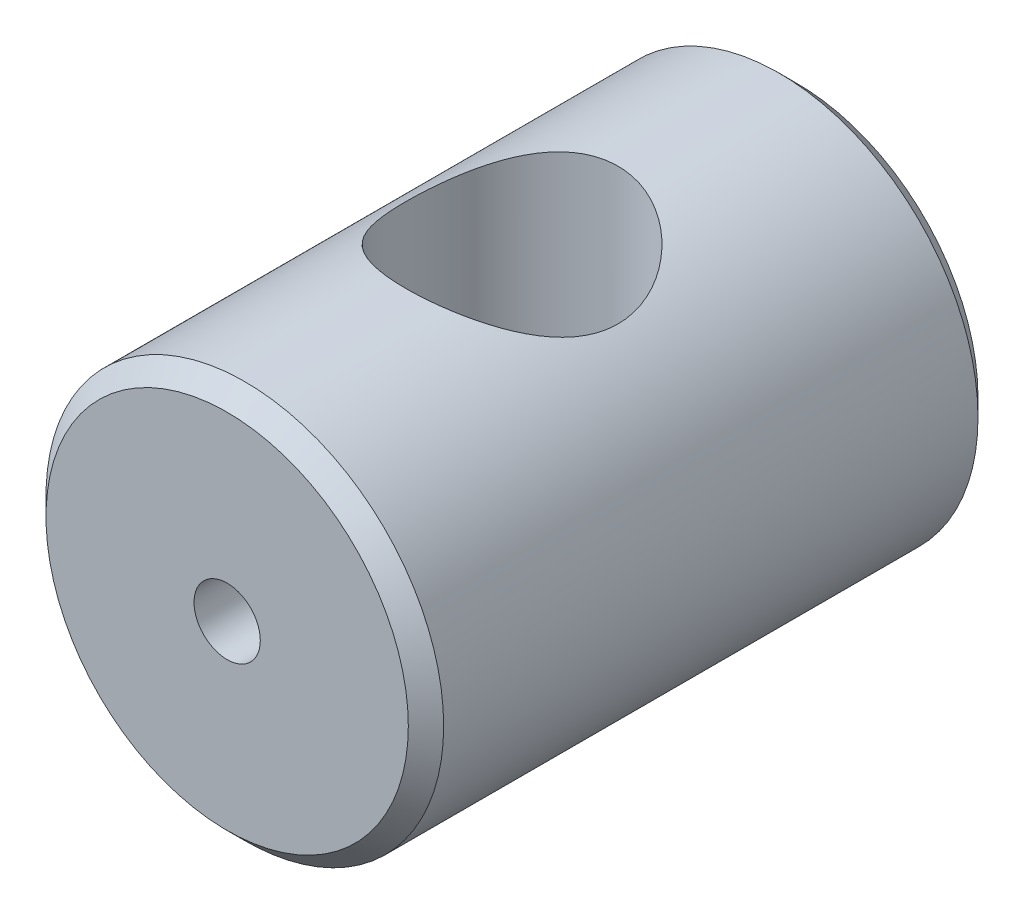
ISO-10303-21;
HEADER;
FILE_DESCRIPTION(('STEP AP214'),'2;1');
FILE_NAME('part.step','',(''),(''),'','','');
FILE_SCHEMA(('AUTOMOTIVE_DESIGN { 1 0 10303 214 1 1 1 1 }'));
ENDSEC;
DATA;
#1=APPLICATION_CONTEXT('core data for automotive mechanical design processes');
#2=APPLICATION_PROTOCOL_DEFINITION('international standard','automotive_design',2000,#1);
#3=PRODUCT_CONTEXT('',#1,'mechanical');
#4=PRODUCT('Part','Part','',(#3));
#5=PRODUCT_RELATED_PRODUCT_CATEGORY('part','',(#4));
#6=PRODUCT_DEFINITION_FORMATION('','',#4);
#7=PRODUCT_DEFINITION_CONTEXT('part definition',#1,'design');
#8=PRODUCT_DEFINITION('design','',#6,#7);
#9=PRODUCT_DEFINITION_SHAPE('','',#8);
#10=(LENGTH_UNIT() NAMED_UNIT(*) SI_UNIT(.MILLI.,.METRE.));
#11=(NAMED_UNIT(*) PLANE_ANGLE_UNIT() SI_UNIT($,.RADIAN.));
#12=(NAMED_UNIT(*) SI_UNIT($,.STERADIAN.) SOLID_ANGLE_UNIT());
#13=UNCERTAINTY_MEASURE_WITH_UNIT(LENGTH_MEASURE(1.E-05),#10,'distance_accuracy_value','');
#14=(GEOMETRIC_REPRESENTATION_CONTEXT(3) GLOBAL_UNCERTAINTY_ASSIGNED_CONTEXT((#13)) GLOBAL_UNIT_ASSIGNED_CONTEXT((#10,
#11,#12)) REPRESENTATION_CONTEXT('',''));
#15=CARTESIAN_POINT('',(0.,0.,0.));
#16=DIRECTION('',(0.,0.,1.));
#17=DIRECTION('',(1.,0.,0.));
#18=AXIS2_PLACEMENT_3D('',#15,#16,#17);
#19=CARTESIAN_POINT('',(0.,0.,0.));
#20=DIRECTION('',(0.,0.,1.));
#21=DIRECTION('',(1.,0.,0.));
#22=AXIS2_PLACEMENT_3D('',#19,#20,#21);
#23=CYLINDRICAL_SURFACE('',#22,3.75);
#24=CARTESIAN_POINT('',(3.75,0.,-43.6318945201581));
#25=CARTESIAN_POINT('',(3.74999861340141,0.20504110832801,-43.6318957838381));
#26=CARTESIAN_POINT('',(3.73312616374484,0.410096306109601,-43.6374873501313));
#27=CARTESIAN_POINT('',(3.66627526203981,0.814182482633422,-43.6591505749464));
#28=CARTESIAN_POINT('',(3.61628786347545,1.01321181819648,-43.6752250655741));
#29=CARTESIAN_POINT('',(3.48509364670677,1.399334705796,-43.7158595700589));
#30=CARTESIAN_POINT('',(3.40394207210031,1.58644869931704,-43.7404045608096));
#31=CARTESIAN_POINT('',(3.2129074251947,1.94445808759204,-43.7951935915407));
#32=CARTESIAN_POINT('',(3.10301927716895,2.11535060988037,-43.8254386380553));
#33=CARTESIAN_POINT('',(2.85358821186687,2.44193660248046,-43.8893852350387));
#34=CARTESIAN_POINT('',(2.71322819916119,2.59699082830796,-43.9231651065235));
#35=CARTESIAN_POINT('',(2.40858613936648,2.88178803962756,-43.9897087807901));
#36=CARTESIAN_POINT('',(2.24430075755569,3.01152749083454,-44.0224724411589));
#37=CARTESIAN_POINT('',(1.89187773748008,3.24483318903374,-44.0841880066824));
#38=CARTESIAN_POINT('',(1.70328466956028,3.34774111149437,-44.1130369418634));
#39=CARTESIAN_POINT('',(1.31041269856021,3.52012814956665,-44.1627579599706));
#40=CARTESIAN_POINT('',(1.10613749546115,3.58961512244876,-44.1836319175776));
#41=CARTESIAN_POINT('',(0.694393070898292,3.69105338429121,-44.2144966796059));
#42=CARTESIAN_POINT('',(0.487217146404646,3.72409724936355,-44.2248035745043));
#43=CARTESIAN_POINT('',(0.0700224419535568,3.75517303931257,-44.2344892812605));
#44=CARTESIAN_POINT('',(-0.139995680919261,3.75321292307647,-44.2338705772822));
#45=CARTESIAN_POINT('',(-0.549223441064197,3.71505512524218,-44.221994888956));
#46=CARTESIAN_POINT('',(-0.748555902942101,3.68004184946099,-44.2111059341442));
#47=CARTESIAN_POINT('',(-1.13835919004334,3.57871502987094,-44.1803658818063));
#48=CARTESIAN_POINT('',(-1.32882943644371,3.51239944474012,-44.1605141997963));
#49=CARTESIAN_POINT('',(-1.69823430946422,3.34958943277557,-44.1135851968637));
#50=CARTESIAN_POINT('',(-1.87699921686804,3.25273557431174,-44.0864224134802));
#51=CARTESIAN_POINT('',(-2.21610753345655,3.03188670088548,-44.0277330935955));
#52=CARTESIAN_POINT('',(-2.37644626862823,2.90788482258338,-43.9962054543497));
#53=CARTESIAN_POINT('',(-2.68121309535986,2.63017909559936,-43.930591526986));
#54=CARTESIAN_POINT('',(-2.82469964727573,2.47545279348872,-43.8964533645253));
#55=CARTESIAN_POINT('',(-3.08396922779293,2.14381469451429,-43.8305998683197));
#56=CARTESIAN_POINT('',(-3.19974899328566,1.96690028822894,-43.798884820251));
#57=CARTESIAN_POINT('',(-3.40141395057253,1.59324759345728,-43.7412068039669));
#58=CARTESIAN_POINT('',(-3.48695042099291,1.39630977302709,-43.715312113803));
#59=CARTESIAN_POINT('',(-3.62335037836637,0.989821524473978,-43.6730077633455));
#60=CARTESIAN_POINT('',(-3.67422632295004,0.780275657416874,-43.6565946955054));
#61=CARTESIAN_POINT('',(-3.73804455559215,0.363540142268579,-43.6358683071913));
#62=CARTESIAN_POINT('',(-3.75242863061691,0.156594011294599,-43.6310953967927));
#63=CARTESIAN_POINT('',(-3.74690233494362,-0.256769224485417,-43.6329137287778));
#64=CARTESIAN_POINT('',(-3.7269972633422,-0.463186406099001,-43.6395032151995));
#65=CARTESIAN_POINT('',(-3.65474620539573,-0.863424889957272,-43.6628501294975));
#66=CARTESIAN_POINT('',(-3.60335493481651,-1.05743782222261,-43.6793080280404));
#67=CARTESIAN_POINT('',(-3.47071120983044,-1.43406537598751,-43.7202200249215));
#68=CARTESIAN_POINT('',(-3.38945388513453,-1.6166781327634,-43.7446754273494));
#69=CARTESIAN_POINT('',(-3.19672531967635,-1.97111732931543,-43.7996975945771));
#70=CARTESIAN_POINT('',(-3.08445442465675,-2.14248424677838,-43.8304195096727));
#71=CARTESIAN_POINT('',(-2.8338192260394,-2.46447103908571,-43.8941918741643));
#72=CARTESIAN_POINT('',(-2.69544814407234,-2.615085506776,-43.927242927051));
#73=CARTESIAN_POINT('',(-2.38971884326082,-2.89773109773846,-43.9936070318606));
#74=CARTESIAN_POINT('',(-2.22139694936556,-3.0287333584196,-44.0268741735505));
#75=CARTESIAN_POINT('',(-1.86435463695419,-3.26067312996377,-44.0885532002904));
#76=CARTESIAN_POINT('',(-1.67563515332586,-3.36161201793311,-44.1169653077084));
#77=CARTESIAN_POINT('',(-1.28431656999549,-3.52959168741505,-44.1655707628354));
#78=CARTESIAN_POINT('',(-1.08183055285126,-3.59687786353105,-44.1858233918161));
#79=CARTESIAN_POINT('',(-0.667671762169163,-3.69621761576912,-44.2160886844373));
#80=CARTESIAN_POINT('',(-0.456001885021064,-3.72828221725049,-44.2261045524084));
#81=CARTESIAN_POINT('',(-0.0389548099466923,-3.75537300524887,-44.2345555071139));
#82=CARTESIAN_POINT('',(0.166317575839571,-3.75188535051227,-44.2334552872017));
#83=CARTESIAN_POINT('',(0.573219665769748,-3.71156456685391,-44.2209107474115));
#84=CARTESIAN_POINT('',(0.774849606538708,-3.67473361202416,-44.2094671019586));
#85=CARTESIAN_POINT('',(1.16626535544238,-3.56971797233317,-44.1776685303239));
#86=CARTESIAN_POINT('',(1.35616775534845,-3.50193117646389,-44.1574268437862));
#87=CARTESIAN_POINT('',(1.72199527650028,-3.33728751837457,-44.1101197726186));
#88=CARTESIAN_POINT('',(1.89791799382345,-3.24042567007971,-44.0830532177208));
#89=CARTESIAN_POINT('',(2.23728508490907,-3.01658172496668,-44.0237783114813));
#90=CARTESIAN_POINT('',(2.40010382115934,-2.88868943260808,-43.9914266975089));
#91=CARTESIAN_POINT('',(2.70246237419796,-2.6080203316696,-43.9256435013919));
#92=CARTESIAN_POINT('',(2.84199520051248,-2.45523607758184,-43.8922115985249));
#93=CARTESIAN_POINT('',(3.09848597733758,-2.1230528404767,-43.8267381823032));
#94=CARTESIAN_POINT('',(3.21454283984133,-1.94293979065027,-43.7947794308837));
#95=CARTESIAN_POINT('',(3.41461412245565,-1.56480563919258,-43.737285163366));
#96=CARTESIAN_POINT('',(3.49864150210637,-1.36679182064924,-43.7117470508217));
#97=CARTESIAN_POINT('',(3.62613541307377,-0.975832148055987,-43.6720782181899));
#98=CARTESIAN_POINT('',(3.6724481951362,-0.783892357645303,-43.6571608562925));
#99=CARTESIAN_POINT('',(3.73437737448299,-0.39463850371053,-43.637069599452));
#100=CARTESIAN_POINT('',(3.75000133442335,-0.197325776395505,-43.631893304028));
#101=CARTESIAN_POINT('',(3.75,0.,-43.6318945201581));
#102=B_SPLINE_CURVE_WITH_KNOTS('',3,(#24,#25,#26,#27,#28,#29,#30,#31,#32,#33,#34,#35,#36,#37,
#38,#39,#40,#41,#42,#43,#44,#45,#46,#47,#48,#49,#50,#51,#52,#53,#54,#55,#56,#57,#58,#59,#60,#61,
#62,#63,#64,#65,#66,#67,#68,#69,#70,#71,#72,#73,#74,#75,#76,#77,#78,#79,#80,#81,#82,#83,#84,#85,
#86,#87,#88,#89,#90,#91,#92,#93,#94,#95,#96,#97,#98,#99,#100,#101),.UNSPECIFIED.,.T.,.F.,(4,2,2,
2,2,2,2,2,2,2,2,2,2,2,2,2,2,2,2,2,2,2,2,2,2,2,2,2,2,2,2,2,2,2,2,2,2,2,4),(0.,0.614394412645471,
1.22895488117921,1.84243093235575,2.45601541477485,3.08871241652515,3.72149768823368,
4.368594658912,5.01553942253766,5.64251168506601,6.26934139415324,6.87452948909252,
7.4797570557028,8.09239213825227,8.70518228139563,9.34351016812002,9.98191319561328,
10.6274541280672,11.2727629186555,11.892147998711,12.5114373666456,13.1128191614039,
13.7142990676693,14.3330283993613,14.9519186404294,15.5964581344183,16.2409680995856,
16.8807071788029,17.5202459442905,18.1331640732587,18.7460422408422,19.3512553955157,
19.9565723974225,20.5824207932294,21.2084567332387,21.8552338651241,22.5017490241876,
23.0931706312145,23.6844464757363),.UNSPECIFIED.);
#103=CARTESIAN_POINT('',(3.75,0.,-43.6318945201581));
#104=VERTEX_POINT('',#103);
#105=EDGE_CURVE('E33',#104,#104,#102,.T.);
#106=ORIENTED_EDGE('',*,*,#105,.T.);
#107=EDGE_LOOP('',(#106));
#108=FACE_BOUND('',#107,.T.);
#109=CARTESIAN_POINT('',(0.,0.,-64.4657628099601));
#110=DIRECTION('',(0.,0.,1.));
#111=DIRECTION('',(1.,0.,0.));
#112=AXIS2_PLACEMENT_3D('',#109,#110,#111);
#113=CIRCLE('',#112,3.75);
#114=CARTESIAN_POINT('',(3.75,0.,-64.4657628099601));
#115=VERTEX_POINT('',#114);
#116=EDGE_CURVE('E104',#115,#115,#113,.T.);
#117=ORIENTED_EDGE('',*,*,#116,.F.);
#118=EDGE_LOOP('',(#117));
#119=FACE_BOUND('',#118,.T.);
#120=ADVANCED_FACE('F29',(#108,#119),#23,.F.);
#121=CARTESIAN_POINT('',(0.,0.,-2.));
#122=DIRECTION('',(0.,0.,-1.));
#123=DIRECTION('',(-1.,0.,0.));
#124=AXIS2_PLACEMENT_3D('',#121,#122,#123);
#125=CONICAL_SURFACE('',#124,22.5,0.785398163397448);
#126=CARTESIAN_POINT('',(0.,0.,0.));
#127=DIRECTION('',(0.,0.,1.));
#128=DIRECTION('',(1.,0.,0.));
#129=AXIS2_PLACEMENT_3D('',#126,#127,#128);
#130=CIRCLE('',#129,20.5);
#131=CARTESIAN_POINT('',(20.5,0.,0.));
#132=VERTEX_POINT('',#131);
#133=EDGE_CURVE('E109',#132,#132,#130,.T.);
#134=ORIENTED_EDGE('',*,*,#133,.F.);
#135=EDGE_LOOP('',(#134));
#136=FACE_BOUND('',#135,.T.);
#137=CARTESIAN_POINT('',(0.,0.,-2.));
#138=DIRECTION('',(0.,0.,1.));
#139=DIRECTION('',(1.,0.,0.));
#140=AXIS2_PLACEMENT_3D('',#137,#138,#139);
#141=CIRCLE('',#140,22.5);
#142=CARTESIAN_POINT('',(22.5,0.,-2.));
#143=VERTEX_POINT('',#142);
#144=EDGE_CURVE('E10',#143,#143,#141,.T.);
#145=ORIENTED_EDGE('',*,*,#144,.T.);
#146=EDGE_LOOP('',(#145));
#147=FACE_BOUND('',#146,.T.);
#148=ADVANCED_FACE('F31',(#136,#147),#125,.T.);
#149=CARTESIAN_POINT('',(0.,0.,0.));
#150=DIRECTION('',(0.,0.,1.));
#151=DIRECTION('',(1.,0.,0.));
#152=AXIS2_PLACEMENT_3D('',#149,#150,#151);
#153=CYLINDRICAL_SURFACE('',#152,22.5);
#154=CARTESIAN_POINT('',(0.,-22.5,-20.2328814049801));
#155=CARTESIAN_POINT('',(0.312987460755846,-22.5000011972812,-20.2328799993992));
#156=CARTESIAN_POINT('',(0.625957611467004,-22.4934556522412,-20.245138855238));
#157=CARTESIAN_POINT('',(1.24955990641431,-22.4674432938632,-20.2940188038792));
#158=CARTESIAN_POINT('',(1.56019121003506,-22.4479720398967,-20.3306482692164));
#159=CARTESIAN_POINT('',(2.17705516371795,-22.3965704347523,-20.4278795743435));
#160=CARTESIAN_POINT('',(2.48328125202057,-22.3646231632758,-20.4885139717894));
#161=CARTESIAN_POINT('',(3.08869256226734,-22.2890788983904,-20.633018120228));
#162=CARTESIAN_POINT('',(3.38787831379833,-22.2454827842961,-20.7168861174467));
#163=CARTESIAN_POINT('',(3.97607237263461,-22.1478977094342,-20.906542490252));
#164=CARTESIAN_POINT('',(4.26511728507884,-22.0939519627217,-21.0122398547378));
#165=CARTESIAN_POINT('',(4.8326395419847,-21.9767959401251,-21.2447224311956));
#166=CARTESIAN_POINT('',(5.111116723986,-21.9135855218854,-21.3715079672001));
#167=CARTESIAN_POINT('',(5.65599633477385,-21.7793118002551,-21.6450293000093));
#168=CARTESIAN_POINT('',(5.92240225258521,-21.7082507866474,-21.7917592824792));
#169=CARTESIAN_POINT('',(6.44212507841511,-21.5597334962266,-22.1041599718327));
#170=CARTESIAN_POINT('',(6.69543675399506,-21.4822746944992,-22.2698381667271));
#171=CARTESIAN_POINT('',(7.20407024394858,-21.3173046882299,-22.6305444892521));
#172=CARTESIAN_POINT('',(7.45842524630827,-21.2294674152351,-22.8267870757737));
#173=CARTESIAN_POINT('',(7.94991361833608,-21.0503515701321,-23.2383482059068));
#174=CARTESIAN_POINT('',(8.18704584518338,-20.9590727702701,-23.4536680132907));
#175=CARTESIAN_POINT('',(8.64326195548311,-20.775094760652,-23.9024267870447));
#176=CARTESIAN_POINT('',(8.86233274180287,-20.682394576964,-24.1358786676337));
#177=CARTESIAN_POINT('',(9.28131663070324,-20.4977946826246,-24.6197604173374));
#178=CARTESIAN_POINT('',(9.48122591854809,-20.4058951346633,-24.870193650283));
#179=CARTESIAN_POINT('',(9.87825035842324,-20.2168946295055,-25.410663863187));
#180=CARTESIAN_POINT('',(10.0734338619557,-20.1200878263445,-25.7022275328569));
#181=CARTESIAN_POINT('',(10.4382761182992,-19.933248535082,-26.3028068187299));
#182=CARTESIAN_POINT('',(10.6079457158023,-19.8432131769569,-26.6118149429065));
#183=CARTESIAN_POINT('',(10.9202934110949,-19.6730482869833,-27.2457001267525));
#184=CARTESIAN_POINT('',(11.062980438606,-19.5929154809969,-27.5705718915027));
#185=CARTESIAN_POINT('',(11.319791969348,-19.4456743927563,-28.2342729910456));
#186=CARTESIAN_POINT('',(11.4339200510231,-19.3785644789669,-28.5731005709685));
#187=CARTESIAN_POINT('',(11.625824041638,-19.2640059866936,-29.240692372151));
#188=CARTESIAN_POINT('',(11.7054238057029,-19.2155919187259,-29.5687654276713));
#189=CARTESIAN_POINT('',(11.8369094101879,-19.1348780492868,-30.2323916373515));
#190=CARTESIAN_POINT('',(11.8887965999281,-19.1025774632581,-30.5679444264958));
#191=CARTESIAN_POINT('',(11.9639290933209,-19.055612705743,-31.2431098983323));
#192=CARTESIAN_POINT('',(11.9872053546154,-19.0409294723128,-31.5827177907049));
#193=CARTESIAN_POINT('',(12.0047828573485,-19.0298533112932,-32.2629630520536));
#194=CARTESIAN_POINT('',(11.999087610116,-19.0334581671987,-32.6036002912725));
#195=CARTESIAN_POINT('',(11.9616887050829,-19.0569767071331,-33.2345610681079));
#196=CARTESIAN_POINT('',(11.9337648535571,-19.0745195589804,-33.5252076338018));
#197=CARTESIAN_POINT('',(11.857011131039,-19.1223255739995,-34.1026712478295));
#198=CARTESIAN_POINT('',(11.8081809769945,-19.152588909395,-34.3894882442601));
#199=CARTESIAN_POINT('',(11.6902009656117,-19.2248269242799,-34.9574676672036));
#200=CARTESIAN_POINT('',(11.6210457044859,-19.2668047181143,-35.2386285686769));
#201=CARTESIAN_POINT('',(11.4631767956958,-19.3611472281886,-35.7936151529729));
#202=CARTESIAN_POINT('',(11.3744619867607,-19.413512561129,-36.0674403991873));
#203=CARTESIAN_POINT('',(11.176136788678,-19.5283736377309,-36.6123674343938));
#204=CARTESIAN_POINT('',(11.0661065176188,-19.5910683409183,-36.8832740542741));
#205=CARTESIAN_POINT('',(10.8273602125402,-19.7240192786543,-37.4148900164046));
#206=CARTESIAN_POINT('',(10.6986379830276,-19.7942780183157,-37.6755959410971));
#207=CARTESIAN_POINT('',(10.423390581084,-19.9405921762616,-38.1857760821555));
#208=CARTESIAN_POINT('',(10.2768627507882,-20.0166484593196,-38.4352486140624));
#209=CARTESIAN_POINT('',(9.96683257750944,-20.1728128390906,-38.9220928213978));
#210=CARTESIAN_POINT('',(9.80332870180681,-20.2529213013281,-39.1594634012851));
#211=CARTESIAN_POINT('',(9.43482417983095,-20.4274701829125,-39.6553504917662));
#212=CARTESIAN_POINT('',(9.22725830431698,-20.5222840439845,-39.911834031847));
#213=CARTESIAN_POINT('',(8.79194288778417,-20.712511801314,-40.4066379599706));
#214=CARTESIAN_POINT('',(8.56419997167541,-20.807925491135,-40.6449642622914));
#215=CARTESIAN_POINT('',(8.08926719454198,-20.9971224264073,-41.1026396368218));
#216=CARTESIAN_POINT('',(7.84205819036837,-21.0909039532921,-41.3219695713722));
#217=CARTESIAN_POINT('',(7.32958495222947,-21.2744267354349,-41.7400628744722));
#218=CARTESIAN_POINT('',(7.06432785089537,-21.3641695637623,-41.9388342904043));
#219=CARTESIAN_POINT('',(6.50044190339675,-21.5426750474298,-42.3258531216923));
#220=CARTESIAN_POINT('',(6.20076575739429,-21.6310564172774,-42.5127552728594));
#221=CARTESIAN_POINT('',(5.58404497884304,-21.7984063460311,-42.8603803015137));
#222=CARTESIAN_POINT('',(5.26699934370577,-21.8773743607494,-43.0211016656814));
#223=CARTESIAN_POINT('',(4.61783640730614,-22.0235370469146,-43.3145039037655));
#224=CARTESIAN_POINT('',(4.28573003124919,-22.0907400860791,-43.4472047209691));
#225=CARTESIAN_POINT('',(3.60875197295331,-22.2113722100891,-43.683005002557));
#226=CARTESIAN_POINT('',(3.26388199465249,-22.2648031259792,-43.7861084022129));
#227=CARTESIAN_POINT('',(2.59579375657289,-22.3520681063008,-43.9533573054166));
#228=CARTESIAN_POINT('',(2.27341574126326,-22.3872319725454,-44.0201715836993));
#229=CARTESIAN_POINT('',(1.62307211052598,-22.4437548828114,-44.1271744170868));
#230=CARTESIAN_POINT('',(1.29510682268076,-22.4651147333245,-44.1673645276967));
#231=CARTESIAN_POINT('',(0.6365177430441,-22.4934086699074,-44.2205392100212));
#232=CARTESIAN_POINT('',(0.305895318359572,-22.5003497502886,-44.2335369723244));
#233=CARTESIAN_POINT('',(-0.355268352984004,-22.4996231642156,-44.2321750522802));
#234=CARTESIAN_POINT('',(-0.685809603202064,-22.4919563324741,-44.2178169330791));
#235=CARTESIAN_POINT('',(-1.31400152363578,-22.4635955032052,-44.1645018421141));
#236=CARTESIAN_POINT('',(-1.61191218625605,-22.4441482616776,-44.1278981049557));
#237=CARTESIAN_POINT('',(-2.20319493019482,-22.3938373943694,-44.0326944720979));
#238=CARTESIAN_POINT('',(-2.49656735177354,-22.3629746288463,-43.9740962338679));
#239=CARTESIAN_POINT('',(-3.07687716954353,-22.2905438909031,-43.8355462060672));
#240=CARTESIAN_POINT('',(-3.36381423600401,-22.2489753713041,-43.7555933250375));
#241=CARTESIAN_POINT('',(-3.92952573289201,-22.1560602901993,-43.5751468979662));
#242=CARTESIAN_POINT('',(-4.20829980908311,-22.1047133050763,-43.4746524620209));
#243=CARTESIAN_POINT('',(-4.76293280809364,-21.9919649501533,-43.2513223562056));
#244=CARTESIAN_POINT('',(-5.03854995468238,-21.9303467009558,-43.1279964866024));
#245=CARTESIAN_POINT('',(-5.57832551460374,-21.7992994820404,-42.8617519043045));
#246=CARTESIAN_POINT('',(-5.84247981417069,-21.7298677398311,-42.7188262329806));
#247=CARTESIAN_POINT('',(-6.3580944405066,-21.5846331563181,-42.4144470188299));
#248=CARTESIAN_POINT('',(-6.60955287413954,-21.5088293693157,-42.2529907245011));
#249=CARTESIAN_POINT('',(-7.09872296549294,-21.3523788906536,-41.9125988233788));
#250=CARTESIAN_POINT('',(-7.33643497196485,-21.2717323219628,-41.7336636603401));
#251=CARTESIAN_POINT('',(-7.82210401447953,-21.0982970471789,-41.3390795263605));
#252=CARTESIAN_POINT('',(-8.06840437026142,-21.0051364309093,-41.1215521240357));
#253=CARTESIAN_POINT('',(-8.54201888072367,-20.8170328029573,-40.6674274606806));
#254=CARTESIAN_POINT('',(-8.76933190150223,-20.7220896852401,-40.4308290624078));
#255=CARTESIAN_POINT('',(-9.20411714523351,-20.532669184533,-39.9394969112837));
#256=CARTESIAN_POINT('',(-9.41157291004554,-20.4381922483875,-39.6847484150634));
#257=CARTESIAN_POINT('',(-9.8054013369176,-20.252198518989,-39.1583542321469));
#258=CARTESIAN_POINT('',(-9.99177057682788,-20.1606822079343,-38.8867058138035));
#259=CARTESIAN_POINT('',(-10.3541352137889,-19.9771340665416,-38.308731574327));
#260=CARTESIAN_POINT('',(-10.5285731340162,-19.8854871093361,-38.0013031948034));
#261=CARTESIAN_POINT('',(-10.8504816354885,-19.7116847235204,-37.3702386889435));
#262=CARTESIAN_POINT('',(-10.9979651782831,-19.6295247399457,-37.0466104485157));
#263=CARTESIAN_POINT('',(-11.2643222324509,-19.477898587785,-36.3852306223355));
#264=CARTESIAN_POINT('',(-11.3832214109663,-19.4084210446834,-36.0474920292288));
#265=CARTESIAN_POINT('',(-11.5909142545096,-19.2851067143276,-35.360107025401));
#266=CARTESIAN_POINT('',(-11.6797132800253,-19.2312671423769,-35.0104627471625));
#267=CARTESIAN_POINT('',(-11.8185839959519,-19.1462014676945,-34.337028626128));
#268=CARTESIAN_POINT('',(-11.871595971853,-19.1132775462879,-34.0140586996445));
#269=CARTESIAN_POINT('',(-11.9510970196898,-19.0636696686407,-33.36362763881));
#270=CARTESIAN_POINT('',(-11.9775880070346,-19.0469845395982,-33.036166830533));
#271=CARTESIAN_POINT('',(-12.0035888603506,-19.0306093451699,-32.3799412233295));
#272=CARTESIAN_POINT('',(-12.0031143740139,-19.0309094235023,-32.0511772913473));
#273=CARTESIAN_POINT('',(-11.9752297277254,-19.04846838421,-31.3952650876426));
#274=CARTESIAN_POINT('',(-11.9478213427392,-19.0657261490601,-31.0681167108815));
#275=CARTESIAN_POINT('',(-11.8715099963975,-19.1133191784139,-30.4580821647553));
#276=CARTESIAN_POINT('',(-11.8256363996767,-19.1418026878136,-30.1746641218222));
#277=CARTESIAN_POINT('',(-11.7140375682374,-19.2102995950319,-29.6130916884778));
#278=CARTESIAN_POINT('',(-11.6483059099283,-19.2503167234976,-29.3349390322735));
#279=CARTESIAN_POINT('',(-11.4977195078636,-19.3406343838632,-28.785628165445));
#280=CARTESIAN_POINT('',(-11.4128670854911,-19.390933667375,-28.5144691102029));
#281=CARTESIAN_POINT('',(-11.2247926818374,-19.5004067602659,-27.9803238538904));
#282=CARTESIAN_POINT('',(-11.1215624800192,-19.5595845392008,-27.717341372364));
#283=CARTESIAN_POINT('',(-10.8903909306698,-19.6892877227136,-27.1842051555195));
#284=CARTESIAN_POINT('',(-10.7612895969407,-19.7602974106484,-26.9146726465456));
#285=CARTESIAN_POINT('',(-10.4841899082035,-19.9087030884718,-26.3873273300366));
#286=CARTESIAN_POINT('',(-10.3361896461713,-19.9860997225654,-26.1295157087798));
#287=CARTESIAN_POINT('',(-10.0221416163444,-20.1454134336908,-25.6264733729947));
#288=CARTESIAN_POINT('',(-9.8560875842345,-20.2273320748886,-25.3812470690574));
#289=CARTESIAN_POINT('',(-9.50678662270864,-20.3938336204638,-24.9042794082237));
#290=CARTESIAN_POINT('',(-9.32353716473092,-20.478416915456,-24.6725400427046));
#291=CARTESIAN_POINT('',(-8.91286790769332,-20.660791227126,-24.190807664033));
#292=CARTESIAN_POINT('',(-8.68289554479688,-20.7587198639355,-23.9430364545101));
#293=CARTESIAN_POINT('',(-8.20264060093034,-20.9531329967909,-23.4675608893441));
#294=CARTESIAN_POINT('',(-7.9523632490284,-21.049617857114,-23.239851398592));
#295=CARTESIAN_POINT('',(-7.43236758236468,-21.2387973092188,-22.805540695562));
#296=CARTESIAN_POINT('',(-7.16263282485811,-21.3314885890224,-22.5989577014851));
#297=CARTESIAN_POINT('',(-6.60520490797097,-21.5106243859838,-22.2085588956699));
#298=CARTESIAN_POINT('',(-6.3175124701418,-21.5970691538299,-22.0247421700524));
#299=CARTESIAN_POINT('',(-5.71839210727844,-21.7634780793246,-21.6771801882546));
#300=CARTESIAN_POINT('',(-5.40655543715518,-21.8432316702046,-21.5140367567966));
#301=CARTESIAN_POINT('',(-4.76756488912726,-21.991540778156,-21.2149536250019));
#302=CARTESIAN_POINT('',(-4.44041297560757,-22.0600977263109,-21.0790104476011));
#303=CARTESIAN_POINT('',(-3.77385042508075,-22.1838383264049,-20.836234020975));
#304=CARTESIAN_POINT('',(-3.43446852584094,-22.2390512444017,-20.7293370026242));
#305=CARTESIAN_POINT('',(-2.74573878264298,-22.3345400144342,-20.5458018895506));
#306=CARTESIAN_POINT('',(-2.39639657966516,-22.3748241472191,-20.4691470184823));
#307=CARTESIAN_POINT('',(-1.70723479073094,-22.437679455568,-20.350041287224));
#308=CARTESIAN_POINT('',(-1.36772862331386,-22.4609876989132,-20.306164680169));
#309=CARTESIAN_POINT('',(-0.685474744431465,-22.4921474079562,-20.2475853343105));
#310=CARTESIAN_POINT('',(-0.342726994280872,-22.4999986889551,-20.2328829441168));
#311=CARTESIAN_POINT('',(0.,-22.5,-20.2328814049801));
#312=B_SPLINE_CURVE_WITH_KNOTS('',3,(#154,#155,#156,#157,#158,#159,#160,#161,#162,#163,#164,
#165,#166,#167,#168,#169,#170,#171,#172,#173,#174,#175,#176,#177,#178,#179,#180,#181,#182,#183,
#184,#185,#186,#187,#188,#189,#190,#191,#192,#193,#194,#195,#196,#197,#198,#199,#200,#201,#202,
#203,#204,#205,#206,#207,#208,#209,#210,#211,#212,#213,#214,#215,#216,#217,#218,#219,#220,#221,
#222,#223,#224,#225,#226,#227,#228,#229,#230,#231,#232,#233,#234,#235,#236,#237,#238,#239,#240,
#241,#242,#243,#244,#245,#246,#247,#248,#249,#250,#251,#252,#253,#254,#255,#256,#257,#258,#259,
#260,#261,#262,#263,#264,#265,#266,#267,#268,#269,#270,#271,#272,#273,#274,#275,#276,#277,#278,
#279,#280,#281,#282,#283,#284,#285,#286,#287,#288,#289,#290,#291,#292,#293,#294,#295,#296,#297,
#298,#299,#300,#301,#302,#303,#304,#305,#306,#307,#308,#309,#310,#311),.UNSPECIFIED.,.T.,.F.,(4,
2,2,2,2,2,2,2,2,2,2,2,2,2,2,2,2,2,2,2,2,2,2,2,2,2,2,2,2,2,2,2,2,2,2,2,2,2,2,2,2,2,2,2,2,2,2,2,2,
2,2,2,2,2,2,2,2,2,2,2,2,2,2,2,2,2,2,2,2,2,2,2,2,2,2,2,2,2,4),(0.,0.938626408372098,
1.87757544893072,2.81780236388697,3.75795832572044,4.69427097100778,5.63059800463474,
6.56665265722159,7.50307850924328,8.50119081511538,9.49936929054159,10.4982653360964,
11.4973598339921,12.5879296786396,13.6780346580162,14.7677782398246,15.8573852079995,
16.8790072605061,17.9005795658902,18.921045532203,19.9413878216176,20.8178842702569,
21.6943925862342,22.5711341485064,23.4479277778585,24.3441718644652,25.2407136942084,
26.1373895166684,27.0341463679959,28.0629489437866,29.0914149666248,30.1209053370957,
31.1499911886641,32.240769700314,33.3316112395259,34.4216737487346,35.5115912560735,
36.5035389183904,37.4954286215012,38.4868370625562,39.4781888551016,40.379479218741,
41.2807016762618,42.1819702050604,43.0832777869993,44.0068311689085,44.9307132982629,
45.8547327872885,46.778728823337,47.8023019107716,48.8259360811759,49.850411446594,
50.8750528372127,51.9690907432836,53.0626011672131,54.1551259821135,55.247456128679,
56.2328489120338,57.2181705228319,58.2029203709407,59.187605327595,60.0521908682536,
60.9170563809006,61.781816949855,62.6469653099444,63.5675813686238,64.4882903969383,
65.4093199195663,66.3304850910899,67.3851488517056,68.439541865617,69.4948365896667,
70.5500889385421,71.6311854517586,72.7121436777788,73.790709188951,74.8686755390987,
75.8964763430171,76.924289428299),.UNSPECIFIED.);
#313=CARTESIAN_POINT('',(0.,-22.5,-20.2328814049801));
#314=VERTEX_POINT('',#313);
#315=EDGE_CURVE('E71',#314,#314,#312,.T.);
#316=ORIENTED_EDGE('',*,*,#315,.T.);
#317=EDGE_LOOP('',(#316));
#318=FACE_BOUND('',#317,.T.);
#319=CARTESIAN_POINT('',(0.,22.5,-20.2328814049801));
#320=CARTESIAN_POINT('',(-0.312987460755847,22.5000011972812,-20.2328799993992));
#321=CARTESIAN_POINT('',(-0.625957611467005,22.4934556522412,-20.245138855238));
#322=CARTESIAN_POINT('',(-1.24955990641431,22.4674432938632,-20.2940188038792));
#323=CARTESIAN_POINT('',(-1.56019121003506,22.4479720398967,-20.3306482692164));
#324=CARTESIAN_POINT('',(-2.17705516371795,22.3965704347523,-20.4278795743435));
#325=CARTESIAN_POINT('',(-2.48328125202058,22.3646231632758,-20.4885139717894));
#326=CARTESIAN_POINT('',(-3.08869256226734,22.2890788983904,-20.633018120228));
#327=CARTESIAN_POINT('',(-3.38787831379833,22.2454827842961,-20.7168861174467));
#328=CARTESIAN_POINT('',(-3.97607237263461,22.1478977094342,-20.906542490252));
#329=CARTESIAN_POINT('',(-4.26511728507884,22.0939519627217,-21.0122398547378));
#330=CARTESIAN_POINT('',(-4.8326395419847,21.9767959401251,-21.2447224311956));
#331=CARTESIAN_POINT('',(-5.111116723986,21.9135855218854,-21.3715079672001));
#332=CARTESIAN_POINT('',(-5.65599633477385,21.7793118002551,-21.6450293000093));
#333=CARTESIAN_POINT('',(-5.92240225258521,21.7082507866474,-21.7917592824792));
#334=CARTESIAN_POINT('',(-6.44212507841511,21.5597334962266,-22.1041599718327));
#335=CARTESIAN_POINT('',(-6.69543675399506,21.4822746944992,-22.2698381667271));
#336=CARTESIAN_POINT('',(-7.20407024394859,21.3173046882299,-22.6305444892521));
#337=CARTESIAN_POINT('',(-7.45842524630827,21.2294674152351,-22.8267870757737));
#338=CARTESIAN_POINT('',(-7.94991361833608,21.0503515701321,-23.2383482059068));
#339=CARTESIAN_POINT('',(-8.18704584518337,20.9590727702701,-23.4536680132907));
#340=CARTESIAN_POINT('',(-8.64326195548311,20.775094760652,-23.9024267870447));
#341=CARTESIAN_POINT('',(-8.86233274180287,20.682394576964,-24.1358786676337));
#342=CARTESIAN_POINT('',(-9.28131663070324,20.4977946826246,-24.6197604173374));
#343=CARTESIAN_POINT('',(-9.48122591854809,20.4058951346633,-24.8701936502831));
#344=CARTESIAN_POINT('',(-9.87825035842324,20.2168946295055,-25.410663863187));
#345=CARTESIAN_POINT('',(-10.0734338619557,20.1200878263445,-25.7022275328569));
#346=CARTESIAN_POINT('',(-10.4382761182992,19.933248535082,-26.3028068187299));
#347=CARTESIAN_POINT('',(-10.6079457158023,19.8432131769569,-26.6118149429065));
#348=CARTESIAN_POINT('',(-10.9202934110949,19.6730482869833,-27.2457001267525));
#349=CARTESIAN_POINT('',(-11.062980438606,19.5929154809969,-27.5705718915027));
#350=CARTESIAN_POINT('',(-11.319791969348,19.4456743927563,-28.2342729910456));
#351=CARTESIAN_POINT('',(-11.4339200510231,19.3785644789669,-28.5731005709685));
#352=CARTESIAN_POINT('',(-11.625824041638,19.2640059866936,-29.240692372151));
#353=CARTESIAN_POINT('',(-11.7054238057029,19.2155919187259,-29.5687654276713));
#354=CARTESIAN_POINT('',(-11.8369094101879,19.1348780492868,-30.2323916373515));
#355=CARTESIAN_POINT('',(-11.8887965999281,19.1025774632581,-30.5679444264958));
#356=CARTESIAN_POINT('',(-11.9639290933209,19.055612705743,-31.2431098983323));
#357=CARTESIAN_POINT('',(-11.9872053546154,19.0409294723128,-31.5827177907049));
#358=CARTESIAN_POINT('',(-12.0047828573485,19.0298533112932,-32.2629630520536));
#359=CARTESIAN_POINT('',(-11.999087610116,19.0334581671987,-32.6036002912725));
#360=CARTESIAN_POINT('',(-11.9616887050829,19.0569767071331,-33.2345610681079));
#361=CARTESIAN_POINT('',(-11.9337648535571,19.0745195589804,-33.5252076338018));
#362=CARTESIAN_POINT('',(-11.857011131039,19.1223255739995,-34.1026712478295));
#363=CARTESIAN_POINT('',(-11.8081809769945,19.152588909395,-34.3894882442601));
#364=CARTESIAN_POINT('',(-11.6902009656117,19.2248269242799,-34.9574676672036));
#365=CARTESIAN_POINT('',(-11.6210457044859,19.2668047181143,-35.2386285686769));
#366=CARTESIAN_POINT('',(-11.4631767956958,19.3611472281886,-35.7936151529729));
#367=CARTESIAN_POINT('',(-11.3744619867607,19.413512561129,-36.0674403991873));
#368=CARTESIAN_POINT('',(-11.176136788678,19.5283736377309,-36.6123674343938));
#369=CARTESIAN_POINT('',(-11.0661065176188,19.5910683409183,-36.8832740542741));
#370=CARTESIAN_POINT('',(-10.8273602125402,19.7240192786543,-37.4148900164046));
#371=CARTESIAN_POINT('',(-10.6986379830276,19.7942780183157,-37.6755959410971));
#372=CARTESIAN_POINT('',(-10.423390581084,19.9405921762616,-38.1857760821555));
#373=CARTESIAN_POINT('',(-10.2768627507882,20.0166484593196,-38.4352486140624));
#374=CARTESIAN_POINT('',(-9.96683257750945,20.1728128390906,-38.9220928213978));
#375=CARTESIAN_POINT('',(-9.80332870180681,20.2529213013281,-39.1594634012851));
#376=CARTESIAN_POINT('',(-9.43482417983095,20.4274701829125,-39.6553504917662));
#377=CARTESIAN_POINT('',(-9.22725830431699,20.5222840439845,-39.911834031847));
#378=CARTESIAN_POINT('',(-8.79194288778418,20.712511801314,-40.4066379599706));
#379=CARTESIAN_POINT('',(-8.56419997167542,20.807925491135,-40.6449642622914));
#380=CARTESIAN_POINT('',(-8.08926719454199,20.9971224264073,-41.1026396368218));
#381=CARTESIAN_POINT('',(-7.84205819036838,21.0909039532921,-41.3219695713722));
#382=CARTESIAN_POINT('',(-7.32958495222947,21.2744267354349,-41.7400628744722));
#383=CARTESIAN_POINT('',(-7.06432785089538,21.3641695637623,-41.9388342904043));
#384=CARTESIAN_POINT('',(-6.50044190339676,21.5426750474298,-42.3258531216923));
#385=CARTESIAN_POINT('',(-6.20076575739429,21.6310564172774,-42.5127552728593));
#386=CARTESIAN_POINT('',(-5.58404497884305,21.7984063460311,-42.8603803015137));
#387=CARTESIAN_POINT('',(-5.26699934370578,21.8773743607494,-43.0211016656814));
#388=CARTESIAN_POINT('',(-4.61783640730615,22.0235370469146,-43.3145039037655));
#389=CARTESIAN_POINT('',(-4.2857300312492,22.090740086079,-43.4472047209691));
#390=CARTESIAN_POINT('',(-3.60875197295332,22.2113722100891,-43.683005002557));
#391=CARTESIAN_POINT('',(-3.2638819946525,22.2648031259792,-43.7861084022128));
#392=CARTESIAN_POINT('',(-2.5957937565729,22.3520681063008,-43.9533573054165));
#393=CARTESIAN_POINT('',(-2.27341574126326,22.3872319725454,-44.0201715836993));
#394=CARTESIAN_POINT('',(-1.62307211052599,22.4437548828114,-44.1271744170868));
#395=CARTESIAN_POINT('',(-1.29510682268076,22.4651147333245,-44.1673645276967));
#396=CARTESIAN_POINT('',(-0.636517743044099,22.4934086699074,-44.2205392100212));
#397=CARTESIAN_POINT('',(-0.305895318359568,22.5003497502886,-44.2335369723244));
#398=CARTESIAN_POINT('',(0.355268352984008,22.4996231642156,-44.2321750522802));
#399=CARTESIAN_POINT('',(0.685809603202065,22.4919563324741,-44.2178169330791));
#400=CARTESIAN_POINT('',(1.31400152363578,22.4635955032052,-44.1645018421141));
#401=CARTESIAN_POINT('',(1.61191218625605,22.4441482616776,-44.1278981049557));
#402=CARTESIAN_POINT('',(2.20319493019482,22.3938373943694,-44.0326944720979));
#403=CARTESIAN_POINT('',(2.49656735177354,22.3629746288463,-43.9740962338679));
#404=CARTESIAN_POINT('',(3.07687716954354,22.2905438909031,-43.8355462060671));
#405=CARTESIAN_POINT('',(3.36381423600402,22.2489753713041,-43.7555933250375));
#406=CARTESIAN_POINT('',(3.92952573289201,22.1560602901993,-43.5751468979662));
#407=CARTESIAN_POINT('',(4.20829980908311,22.1047133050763,-43.4746524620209));
#408=CARTESIAN_POINT('',(4.76293280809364,21.9919649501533,-43.2513223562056));
#409=CARTESIAN_POINT('',(5.03854995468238,21.9303467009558,-43.1279964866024));
#410=CARTESIAN_POINT('',(5.57832551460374,21.7992994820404,-42.8617519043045));
#411=CARTESIAN_POINT('',(5.84247981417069,21.7298677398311,-42.7188262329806));
#412=CARTESIAN_POINT('',(6.3580944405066,21.5846331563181,-42.4144470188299));
#413=CARTESIAN_POINT('',(6.60955287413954,21.5088293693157,-42.2529907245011));
#414=CARTESIAN_POINT('',(7.09872296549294,21.3523788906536,-41.9125988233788));
#415=CARTESIAN_POINT('',(7.33643497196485,21.2717323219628,-41.7336636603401));
#416=CARTESIAN_POINT('',(7.82210401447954,21.0982970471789,-41.3390795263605));
#417=CARTESIAN_POINT('',(8.06840437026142,21.0051364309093,-41.1215521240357));
#418=CARTESIAN_POINT('',(8.54201888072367,20.8170328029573,-40.6674274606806));
#419=CARTESIAN_POINT('',(8.76933190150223,20.7220896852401,-40.4308290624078));
#420=CARTESIAN_POINT('',(9.20411714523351,20.532669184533,-39.9394969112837));
#421=CARTESIAN_POINT('',(9.41157291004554,20.4381922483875,-39.6847484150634));
#422=CARTESIAN_POINT('',(9.8054013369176,20.252198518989,-39.1583542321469));
#423=CARTESIAN_POINT('',(9.99177057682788,20.1606822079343,-38.8867058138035));
#424=CARTESIAN_POINT('',(10.3541352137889,19.9771340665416,-38.308731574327));
#425=CARTESIAN_POINT('',(10.5285731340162,19.8854871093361,-38.0013031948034));
#426=CARTESIAN_POINT('',(10.8504816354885,19.7116847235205,-37.3702386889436));
#427=CARTESIAN_POINT('',(10.9979651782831,19.6295247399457,-37.0466104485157));
#428=CARTESIAN_POINT('',(11.2643222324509,19.477898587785,-36.3852306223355));
#429=CARTESIAN_POINT('',(11.3832214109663,19.4084210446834,-36.0474920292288));
#430=CARTESIAN_POINT('',(11.5909142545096,19.2851067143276,-35.360107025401));
#431=CARTESIAN_POINT('',(11.6797132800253,19.2312671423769,-35.0104627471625));
#432=CARTESIAN_POINT('',(11.8185839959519,19.1462014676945,-34.337028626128));
#433=CARTESIAN_POINT('',(11.871595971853,19.1132775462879,-34.0140586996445));
#434=CARTESIAN_POINT('',(11.9510970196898,19.0636696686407,-33.36362763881));
#435=CARTESIAN_POINT('',(11.9775880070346,19.0469845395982,-33.036166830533));
#436=CARTESIAN_POINT('',(12.0035888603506,19.0306093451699,-32.3799412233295));
#437=CARTESIAN_POINT('',(12.0031143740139,19.0309094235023,-32.0511772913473));
#438=CARTESIAN_POINT('',(11.9752297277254,19.04846838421,-31.3952650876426));
#439=CARTESIAN_POINT('',(11.9478213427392,19.0657261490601,-31.0681167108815));
#440=CARTESIAN_POINT('',(11.8715099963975,19.1133191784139,-30.4580821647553));
#441=CARTESIAN_POINT('',(11.8256363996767,19.1418026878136,-30.1746641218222));
#442=CARTESIAN_POINT('',(11.7140375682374,19.2102995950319,-29.6130916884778));
#443=CARTESIAN_POINT('',(11.6483059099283,19.2503167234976,-29.3349390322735));
#444=CARTESIAN_POINT('',(11.4977195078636,19.3406343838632,-28.785628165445));
#445=CARTESIAN_POINT('',(11.4128670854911,19.390933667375,-28.5144691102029));
#446=CARTESIAN_POINT('',(11.2247926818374,19.5004067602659,-27.9803238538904));
#447=CARTESIAN_POINT('',(11.1215624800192,19.5595845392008,-27.717341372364));
#448=CARTESIAN_POINT('',(10.8903909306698,19.6892877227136,-27.1842051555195));
#449=CARTESIAN_POINT('',(10.7612895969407,19.7602974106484,-26.9146726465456));
#450=CARTESIAN_POINT('',(10.4841899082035,19.9087030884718,-26.3873273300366));
#451=CARTESIAN_POINT('',(10.3361896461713,19.9860997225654,-26.1295157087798));
#452=CARTESIAN_POINT('',(10.0221416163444,20.1454134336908,-25.6264733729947));
#453=CARTESIAN_POINT('',(9.85608758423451,20.2273320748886,-25.3812470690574));
#454=CARTESIAN_POINT('',(9.50678662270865,20.3938336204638,-24.9042794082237));
#455=CARTESIAN_POINT('',(9.32353716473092,20.478416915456,-24.6725400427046));
#456=CARTESIAN_POINT('',(8.91286790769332,20.660791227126,-24.190807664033));
#457=CARTESIAN_POINT('',(8.68289554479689,20.7587198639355,-23.9430364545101));
#458=CARTESIAN_POINT('',(8.20264060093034,20.9531329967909,-23.4675608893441));
#459=CARTESIAN_POINT('',(7.9523632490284,21.049617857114,-23.239851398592));
#460=CARTESIAN_POINT('',(7.43236758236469,21.2387973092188,-22.805540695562));
#461=CARTESIAN_POINT('',(7.16263282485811,21.3314885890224,-22.5989577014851));
#462=CARTESIAN_POINT('',(6.60520490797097,21.5106243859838,-22.2085588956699));
#463=CARTESIAN_POINT('',(6.3175124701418,21.5970691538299,-22.0247421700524));
#464=CARTESIAN_POINT('',(5.71839210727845,21.7634780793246,-21.6771801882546));
#465=CARTESIAN_POINT('',(5.40655543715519,21.8432316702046,-21.5140367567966));
#466=CARTESIAN_POINT('',(4.76756488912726,21.991540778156,-21.2149536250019));
#467=CARTESIAN_POINT('',(4.44041297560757,22.0600977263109,-21.0790104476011));
#468=CARTESIAN_POINT('',(3.77385042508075,22.1838383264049,-20.836234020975));
#469=CARTESIAN_POINT('',(3.43446852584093,22.2390512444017,-20.7293370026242));
#470=CARTESIAN_POINT('',(2.74573878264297,22.3345400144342,-20.5458018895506));
#471=CARTESIAN_POINT('',(2.39639657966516,22.3748241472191,-20.4691470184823));
#472=CARTESIAN_POINT('',(1.70723479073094,22.437679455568,-20.350041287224));
#473=CARTESIAN_POINT('',(1.36772862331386,22.4609876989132,-20.306164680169));
#474=CARTESIAN_POINT('',(0.685474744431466,22.4921474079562,-20.2475853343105));
#475=CARTESIAN_POINT('',(0.342726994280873,22.4999986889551,-20.2328829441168));
#476=CARTESIAN_POINT('',(0.,22.5,-20.2328814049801));
#477=B_SPLINE_CURVE_WITH_KNOTS('',3,(#319,#320,#321,#322,#323,#324,#325,#326,#327,#328,#329,
#330,#331,#332,#333,#334,#335,#336,#337,#338,#339,#340,#341,#342,#343,#344,#345,#346,#347,#348,
#349,#350,#351,#352,#353,#354,#355,#356,#357,#358,#359,#360,#361,#362,#363,#364,#365,#366,#367,
#368,#369,#370,#371,#372,#373,#374,#375,#376,#377,#378,#379,#380,#381,#382,#383,#384,#385,#386,
#387,#388,#389,#390,#391,#392,#393,#394,#395,#396,#397,#398,#399,#400,#401,#402,#403,#404,#405,
#406,#407,#408,#409,#410,#411,#412,#413,#414,#415,#416,#417,#418,#419,#420,#421,#422,#423,#424,
#425,#426,#427,#428,#429,#430,#431,#432,#433,#434,#435,#436,#437,#438,#439,#440,#441,#442,#443,
#444,#445,#446,#447,#448,#449,#450,#451,#452,#453,#454,#455,#456,#457,#458,#459,#460,#461,#462,
#463,#464,#465,#466,#467,#468,#469,#470,#471,#472,#473,#474,#475,#476),.UNSPECIFIED.,.T.,.F.,(4,
2,2,2,2,2,2,2,2,2,2,2,2,2,2,2,2,2,2,2,2,2,2,2,2,2,2,2,2,2,2,2,2,2,2,2,2,2,2,2,2,2,2,2,2,2,2,2,2,
2,2,2,2,2,2,2,2,2,2,2,2,2,2,2,2,2,2,2,2,2,2,2,2,2,2,2,2,2,4),(0.,0.938626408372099,
1.87757544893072,2.81780236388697,3.75795832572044,4.69427097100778,5.63059800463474,
6.56665265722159,7.50307850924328,8.50119081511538,9.49936929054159,10.4982653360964,
11.4973598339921,12.5879296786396,13.6780346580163,14.7677782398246,15.8573852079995,
16.8790072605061,17.9005795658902,18.921045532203,19.9413878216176,20.8178842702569,
21.6943925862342,22.5711341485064,23.4479277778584,24.3441718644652,25.2407136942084,
26.1373895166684,27.0341463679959,28.0629489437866,29.0914149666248,30.1209053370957,
31.1499911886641,32.240769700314,33.3316112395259,34.4216737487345,35.5115912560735,
36.5035389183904,37.4954286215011,38.4868370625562,39.4781888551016,40.3794792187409,
41.2807016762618,42.1819702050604,43.0832777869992,44.0068311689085,44.9307132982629,
45.8547327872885,46.778728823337,47.8023019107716,48.8259360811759,49.850411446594,
50.8750528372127,51.9690907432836,53.0626011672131,54.1551259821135,55.247456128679,
56.2328489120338,57.2181705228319,58.2029203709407,59.1876053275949,60.0521908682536,
60.9170563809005,61.7818169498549,62.6469653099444,63.5675813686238,64.4882903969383,
65.4093199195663,66.3304850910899,67.3851488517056,68.439541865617,69.4948365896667,
70.5500889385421,71.6311854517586,72.7121436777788,73.790709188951,74.8686755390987,
75.8964763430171,76.924289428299),.UNSPECIFIED.);
#478=CARTESIAN_POINT('',(0.,22.5,-20.2328814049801));
#479=VERTEX_POINT('',#478);
#480=EDGE_CURVE('E67',#479,#479,#477,.T.);
#481=ORIENTED_EDGE('',*,*,#480,.T.);
#482=EDGE_LOOP('',(#481));
#483=FACE_BOUND('',#482,.T.);
#484=ORIENTED_EDGE('',*,*,#144,.F.);
#485=EDGE_LOOP('',(#484));
#486=FACE_BOUND('',#485,.T.);
#487=CARTESIAN_POINT('',(0.,0.,-62.4657628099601));
#488=DIRECTION('',(0.,0.,1.));
#489=DIRECTION('',(1.,0.,0.));
#490=AXIS2_PLACEMENT_3D('',#487,#488,#489);
#491=CIRCLE('',#490,22.5);
#492=CARTESIAN_POINT('',(22.5,0.,-62.4657628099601));
#493=VERTEX_POINT('',#492);
#494=EDGE_CURVE('E41',#493,#493,#491,.T.);
#495=ORIENTED_EDGE('',*,*,#494,.T.);
#496=EDGE_LOOP('',(#495));
#497=FACE_BOUND('',#496,.T.);
#498=ADVANCED_FACE('F75',(#318,#483,#486,#497),#153,.T.);
#499=CARTESIAN_POINT('',(0.,0.,-64.4657628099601));
#500=DIRECTION('',(0.,0.,1.));
#501=DIRECTION('',(1.,0.,0.));
#502=AXIS2_PLACEMENT_3D('',#499,#500,#501);
#503=CONICAL_SURFACE('',#502,20.5,0.785398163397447);
#504=ORIENTED_EDGE('',*,*,#494,.F.);
#505=EDGE_LOOP('',(#504));
#506=FACE_BOUND('',#505,.T.);
#507=CARTESIAN_POINT('',(0.,0.,-64.4657628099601));
#508=DIRECTION('',(0.,0.,1.));
#509=DIRECTION('',(1.,0.,0.));
#510=AXIS2_PLACEMENT_3D('',#507,#508,#509);
#511=CIRCLE('',#510,20.5);
#512=CARTESIAN_POINT('',(20.5,0.,-64.4657628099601));
#513=VERTEX_POINT('',#512);
#514=EDGE_CURVE('E46',#513,#513,#511,.T.);
#515=ORIENTED_EDGE('',*,*,#514,.T.);
#516=EDGE_LOOP('',(#515));
#517=FACE_BOUND('',#516,.T.);
#518=ADVANCED_FACE('F79',(#506,#517),#503,.T.);
#519=CARTESIAN_POINT('',(0.,20.5,-64.4657628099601));
#520=DIRECTION('',(0.,0.,1.));
#521=DIRECTION('',(1.,0.,0.));
#522=AXIS2_PLACEMENT_3D('',#519,#520,#521);
#523=PLANE('',#522);
#524=ORIENTED_EDGE('',*,*,#514,.F.);
#525=EDGE_LOOP('',(#524));
#526=FACE_BOUND('',#525,.T.);
#527=ORIENTED_EDGE('',*,*,#116,.T.);
#528=EDGE_LOOP('',(#527));
#529=FACE_BOUND('',#528,.T.);
#530=ADVANCED_FACE('F83',(#526,#529),#523,.F.);
#531=CARTESIAN_POINT('',(3.75,0.,-20.8338682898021));
#532=CARTESIAN_POINT('',(3.74999861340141,-0.20504110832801,-20.833867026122));
#533=CARTESIAN_POINT('',(3.73312616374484,-0.410096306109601,-20.8282754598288));
#534=CARTESIAN_POINT('',(3.66627526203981,-0.814182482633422,-20.8066122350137));
#535=CARTESIAN_POINT('',(3.61628786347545,-1.01321181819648,-20.790537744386));
#536=CARTESIAN_POINT('',(3.48509364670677,-1.399334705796,-20.7499032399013));
#537=CARTESIAN_POINT('',(3.40394207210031,-1.58644869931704,-20.7253582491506));
#538=CARTESIAN_POINT('',(3.21290742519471,-1.94445808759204,-20.6705692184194));
#539=CARTESIAN_POINT('',(3.10301927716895,-2.11535060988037,-20.6403241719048));
#540=CARTESIAN_POINT('',(2.85358821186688,-2.44193660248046,-20.5763775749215));
#541=CARTESIAN_POINT('',(2.71322819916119,-2.59699082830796,-20.5425977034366));
#542=CARTESIAN_POINT('',(2.40858613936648,-2.88178803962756,-20.47605402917));
#543=CARTESIAN_POINT('',(2.24430075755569,-3.01152749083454,-20.4432903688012));
#544=CARTESIAN_POINT('',(1.89187773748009,-3.24483318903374,-20.3815748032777));
#545=CARTESIAN_POINT('',(1.70328466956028,-3.34774111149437,-20.3527258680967));
#546=CARTESIAN_POINT('',(1.31041269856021,-3.52012814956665,-20.3030048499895));
#547=CARTESIAN_POINT('',(1.10613749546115,-3.58961512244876,-20.2821308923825));
#548=CARTESIAN_POINT('',(0.694393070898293,-3.69105338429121,-20.2512661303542));
#549=CARTESIAN_POINT('',(0.487217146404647,-3.72409724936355,-20.2409592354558));
#550=CARTESIAN_POINT('',(0.0700224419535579,-3.75517303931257,-20.2312735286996));
#551=CARTESIAN_POINT('',(-0.13999568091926,-3.75321292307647,-20.2318922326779));
#552=CARTESIAN_POINT('',(-0.549223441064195,-3.71505512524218,-20.2437679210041));
#553=CARTESIAN_POINT('',(-0.748555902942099,-3.68004184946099,-20.2546568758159));
#554=CARTESIAN_POINT('',(-1.13835919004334,-3.57871502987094,-20.2853969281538));
#555=CARTESIAN_POINT('',(-1.32882943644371,-3.51239944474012,-20.3052486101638));
#556=CARTESIAN_POINT('',(-1.69823430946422,-3.34958943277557,-20.3521776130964));
#557=CARTESIAN_POINT('',(-1.87699921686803,-3.25273557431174,-20.3793403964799));
#558=CARTESIAN_POINT('',(-2.21610753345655,-3.03188670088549,-20.4380297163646));
#559=CARTESIAN_POINT('',(-2.37644626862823,-2.90788482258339,-20.4695573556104));
#560=CARTESIAN_POINT('',(-2.68121309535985,-2.63017909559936,-20.5351712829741));
#561=CARTESIAN_POINT('',(-2.82469964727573,-2.47545279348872,-20.5693094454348));
#562=CARTESIAN_POINT('',(-3.08396922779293,-2.14381469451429,-20.6351629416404));
#563=CARTESIAN_POINT('',(-3.19974899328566,-1.96690028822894,-20.6668779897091));
#564=CARTESIAN_POINT('',(-3.40141395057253,-1.59324759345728,-20.7245560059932));
#565=CARTESIAN_POINT('',(-3.48695042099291,-1.39630977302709,-20.7504506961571));
#566=CARTESIAN_POINT('',(-3.62335037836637,-0.989821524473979,-20.7927550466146));
#567=CARTESIAN_POINT('',(-3.67422632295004,-0.780275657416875,-20.8091681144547));
#568=CARTESIAN_POINT('',(-3.73804455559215,-0.36354014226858,-20.8298945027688));
#569=CARTESIAN_POINT('',(-3.75242863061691,-0.156594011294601,-20.8346674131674));
#570=CARTESIAN_POINT('',(-3.74690233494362,0.256769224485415,-20.8328490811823));
#571=CARTESIAN_POINT('',(-3.7269972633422,0.463186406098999,-20.8262595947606));
#572=CARTESIAN_POINT('',(-3.65474620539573,0.863424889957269,-20.8029126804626));
#573=CARTESIAN_POINT('',(-3.60335493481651,1.0574378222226,-20.7864547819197));
#574=CARTESIAN_POINT('',(-3.47071120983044,1.4340653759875,-20.7455427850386));
#575=CARTESIAN_POINT('',(-3.38945388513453,1.6166781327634,-20.7210873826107));
#576=CARTESIAN_POINT('',(-3.19672531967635,1.97111732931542,-20.666065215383));
#577=CARTESIAN_POINT('',(-3.08445442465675,2.14248424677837,-20.6353433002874));
#578=CARTESIAN_POINT('',(-2.8338192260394,2.46447103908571,-20.5715709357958));
#579=CARTESIAN_POINT('',(-2.69544814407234,2.615085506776,-20.5385198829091));
#580=CARTESIAN_POINT('',(-2.38971884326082,2.89773109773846,-20.4721557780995));
#581=CARTESIAN_POINT('',(-2.22139694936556,3.0287333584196,-20.4388886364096));
#582=CARTESIAN_POINT('',(-1.86435463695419,3.26067312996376,-20.3772096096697));
#583=CARTESIAN_POINT('',(-1.67563515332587,3.36161201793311,-20.3487975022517));
#584=CARTESIAN_POINT('',(-1.2843165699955,3.52959168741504,-20.3001920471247));
#585=CARTESIAN_POINT('',(-1.08183055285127,3.59687786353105,-20.279939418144));
#586=CARTESIAN_POINT('',(-0.667671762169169,3.69621761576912,-20.2496741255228));
#587=CARTESIAN_POINT('',(-0.45600188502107,3.72828221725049,-20.2396582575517));
#588=CARTESIAN_POINT('',(-0.0389548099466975,3.75537300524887,-20.2312073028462));
#589=CARTESIAN_POINT('',(0.166317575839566,3.75188535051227,-20.2323075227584));
#590=CARTESIAN_POINT('',(0.573219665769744,3.71156456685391,-20.2448520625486));
#591=CARTESIAN_POINT('',(0.774849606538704,3.67473361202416,-20.2562957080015));
#592=CARTESIAN_POINT('',(1.16626535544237,3.56971797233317,-20.2880942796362));
#593=CARTESIAN_POINT('',(1.35616775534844,3.50193117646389,-20.3083359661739));
#594=CARTESIAN_POINT('',(1.72199527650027,3.33728751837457,-20.3556430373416));
#595=CARTESIAN_POINT('',(1.89791799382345,3.24042567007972,-20.3827095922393));
#596=CARTESIAN_POINT('',(2.23728508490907,3.01658172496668,-20.4419844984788));
#597=CARTESIAN_POINT('',(2.40010382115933,2.88868943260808,-20.4743361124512));
#598=CARTESIAN_POINT('',(2.70246237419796,2.60802033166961,-20.5401193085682));
#599=CARTESIAN_POINT('',(2.84199520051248,2.45523607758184,-20.5735512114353));
#600=CARTESIAN_POINT('',(3.09848597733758,2.1230528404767,-20.6390246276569));
#601=CARTESIAN_POINT('',(3.21454283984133,1.94293979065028,-20.6709833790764));
#602=CARTESIAN_POINT('',(3.41461412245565,1.56480563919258,-20.7284776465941));
#603=CARTESIAN_POINT('',(3.49864150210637,1.36679182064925,-20.7540157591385));
#604=CARTESIAN_POINT('',(3.62613541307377,0.975832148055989,-20.7936845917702));
#605=CARTESIAN_POINT('',(3.6724481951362,0.783892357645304,-20.8086019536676));
#606=CARTESIAN_POINT('',(3.73437737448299,0.39463850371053,-20.8286932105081));
#607=CARTESIAN_POINT('',(3.75000133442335,0.197325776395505,-20.8338695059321));
#608=CARTESIAN_POINT('',(3.75,0.,-20.8338682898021));
#609=B_SPLINE_CURVE_WITH_KNOTS('',3,(#531,#532,#533,#534,#535,#536,#537,#538,#539,#540,#541,
#542,#543,#544,#545,#546,#547,#548,#549,#550,#551,#552,#553,#554,#555,#556,#557,#558,#559,#560,
#561,#562,#563,#564,#565,#566,#567,#568,#569,#570,#571,#572,#573,#574,#575,#576,#577,#578,#579,
#580,#581,#582,#583,#584,#585,#586,#587,#588,#589,#590,#591,#592,#593,#594,#595,#596,#597,#598,
#599,#600,#601,#602,#603,#604,#605,#606,#607,#608),.UNSPECIFIED.,.T.,.F.,(4,2,2,2,2,2,2,2,2,2,2,
2,2,2,2,2,2,2,2,2,2,2,2,2,2,2,2,2,2,2,2,2,2,2,2,2,2,2,4),(0.,0.614394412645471,1.22895488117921,
1.84243093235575,2.45601541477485,3.08871241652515,3.72149768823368,4.368594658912,
5.01553942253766,5.64251168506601,6.26934139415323,6.87452948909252,7.4797570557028,
8.09239213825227,8.70518228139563,9.34351016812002,9.98191319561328,10.6274541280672,
11.2727629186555,11.892147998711,12.5114373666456,13.1128191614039,13.7142990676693,
14.3330283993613,14.9519186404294,15.5964581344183,16.2409680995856,16.8807071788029,
17.5202459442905,18.1331640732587,18.7460422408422,19.3512553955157,19.9565723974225,
20.5824207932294,21.2084567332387,21.8552338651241,22.5017490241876,23.0931706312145,
23.6844464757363),.UNSPECIFIED.);
#610=CARTESIAN_POINT('',(3.75,0.,-20.8338682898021));
#611=VERTEX_POINT('',#610);
#612=EDGE_CURVE('E49',#611,#611,#609,.T.);
#613=ORIENTED_EDGE('',*,*,#612,.T.);
#614=EDGE_LOOP('',(#613));
#615=FACE_BOUND('',#614,.T.);
#616=CARTESIAN_POINT('',(0.,0.,0.));
#617=DIRECTION('',(0.,0.,1.));
#618=DIRECTION('',(1.,0.,0.));
#619=AXIS2_PLACEMENT_3D('',#616,#617,#618);
#620=CIRCLE('',#619,3.75);
#621=CARTESIAN_POINT('',(3.75,0.,0.));
#622=VERTEX_POINT('',#621);
#623=EDGE_CURVE('E105',#622,#622,#620,.T.);
#624=ORIENTED_EDGE('',*,*,#623,.T.);
#625=EDGE_LOOP('',(#624));
#626=FACE_BOUND('',#625,.T.);
#627=ADVANCED_FACE('F53',(#615,#626),#23,.F.);
#628=CARTESIAN_POINT('',(0.,3.75,0.));
#629=DIRECTION('',(0.,0.,-1.));
#630=DIRECTION('',(-1.,0.,0.));
#631=AXIS2_PLACEMENT_3D('',#628,#629,#630);
#632=PLANE('',#631);
#633=ORIENTED_EDGE('',*,*,#623,.F.);
#634=EDGE_LOOP('',(#633));
#635=FACE_BOUND('',#634,.T.);
#636=ORIENTED_EDGE('',*,*,#133,.T.);
#637=EDGE_LOOP('',(#636));
#638=FACE_BOUND('',#637,.T.);
#639=ADVANCED_FACE('F60',(#635,#638),#632,.F.);
#640=CARTESIAN_POINT('',(0.,-30.,-32.2328814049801));
#641=DIRECTION('',(0.,1.,0.));
#642=DIRECTION('',(0.,0.,1.));
#643=AXIS2_PLACEMENT_3D('',#640,#641,#642);
#644=CYLINDRICAL_SURFACE('',#643,12.);
#645=ORIENTED_EDGE('',*,*,#480,.F.);
#646=EDGE_LOOP('',(#645));
#647=FACE_BOUND('',#646,.T.);
#648=ORIENTED_EDGE('',*,*,#612,.F.);
#649=EDGE_LOOP('',(#648));
#650=FACE_BOUND('',#649,.T.);
#651=ORIENTED_EDGE('',*,*,#105,.F.);
#652=EDGE_LOOP('',(#651));
#653=FACE_BOUND('',#652,.T.);
#654=ORIENTED_EDGE('',*,*,#315,.F.);
#655=EDGE_LOOP('',(#654));
#656=FACE_BOUND('',#655,.T.);
#657=ADVANCED_FACE('F57',(#647,#650,#653,#656),#644,.F.);
#658=CLOSED_SHELL('',(#120,#148,#498,#518,#530,#627,#639,#657));
#659=MANIFOLD_SOLID_BREP('B2',#658);
#660=ADVANCED_BREP_SHAPE_REPRESENTATION('',(#18,#659),#14);
#661=SHAPE_DEFINITION_REPRESENTATION(#9,#660);
ENDSEC;
END-ISO-10303-21;
